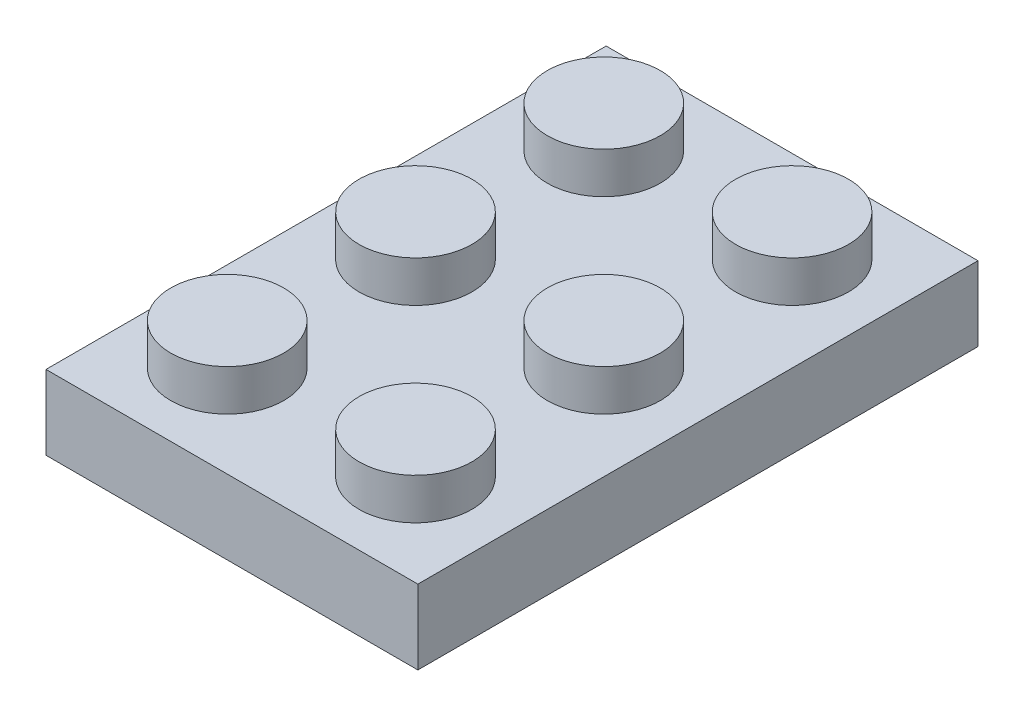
from build123d import *

# Parameters (mm, degrees)
SKETCH1_W       = 15.8
SKETCH1_H       = 23.8
EXTRUDE1_DEPTH  = 3.16
SKETCH2_R       = 2.4
EXTRUDE4_DEPTH  = 1.75
SKETCH5_W       = 12.3
SKETCH5_H       = 20.3
EXTRUDE5_DEPTH  = 2.5
SKETCH6_R       = 3.4
EXTRUDE6_DEPTH  = 2.5
SKETCH7_R       = 2.4
EXTRUDE7_DEPTH  = 2.5
LPATTERN1_COUNT = 2
LPATTERN1_PITCH = 8


with BuildPart() as part:
    # Sketch1 → Extrude1 (new body)
    with BuildSketch(Plane(origin=(0, 0, 0), x_dir=(1, 0, 0), z_dir=(0, 1, 0))):
        with Locations((-7.9, 11.9)):
            Rectangle(SKETCH1_W, SKETCH1_H)
    extrude(amount=EXTRUDE1_DEPTH)

    # Sketch2 → Extrude4 (add)
    with BuildSketch(Plane(origin=(0, 3.16, 0), x_dir=(-1, 0, 0), z_dir=(0, 1, 0))):
        with Locations(Location((4, -19.9, 0), (0, 0, 90))):
            Circle(SKETCH2_R)
        with Locations(Location((4, -11.9, 0), (0, 0, 90))):
            Circle(SKETCH2_R)
        with Locations(Location((4, -3.9, 0), (0, 0, 90))):
            Circle(SKETCH2_R)
    extrude4 = extrude(amount=EXTRUDE4_DEPTH)

    # Sketch5 → Extrude5 (cut)
    with BuildSketch(Plane.XZ):
        with Locations((-7.9, -11.9)):
            Rectangle(SKETCH5_W, SKETCH5_H)
    extrude(amount=-EXTRUDE5_DEPTH, mode=Mode.SUBTRACT)

    # Sketch6 → Extrude6 (add)
    with BuildSketch(Plane.XZ.offset(-2.5)):
        with Locations(Location((-8.049220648, -8, 0), (0, 0, 270))):
            Circle(SKETCH6_R)
        with Locations(Location((-8.049220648, -16, 0), (0, 0, 270))):
            Circle(SKETCH6_R)
    extrude(amount=EXTRUDE6_DEPTH)

    # Sketch7 → Extrude7 (cut)
    with BuildSketch(Plane.XZ):
        with Locations(Location((-8.049220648, -8, 0), (0, 0, 270))):
            Circle(SKETCH7_R)
        with Locations(Location((-8.049220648, -16, 0), (0, 0, 270))):
            Circle(SKETCH7_R)
    extrude(amount=-EXTRUDE7_DEPTH, mode=Mode.SUBTRACT)

    # LPattern1: Extrude4 ×2
    with Locations(*[(-i * LPATTERN1_PITCH, 0, 0) for i in range(1, LPATTERN1_COUNT)]):
        add(extrude4)


solid = part.part
